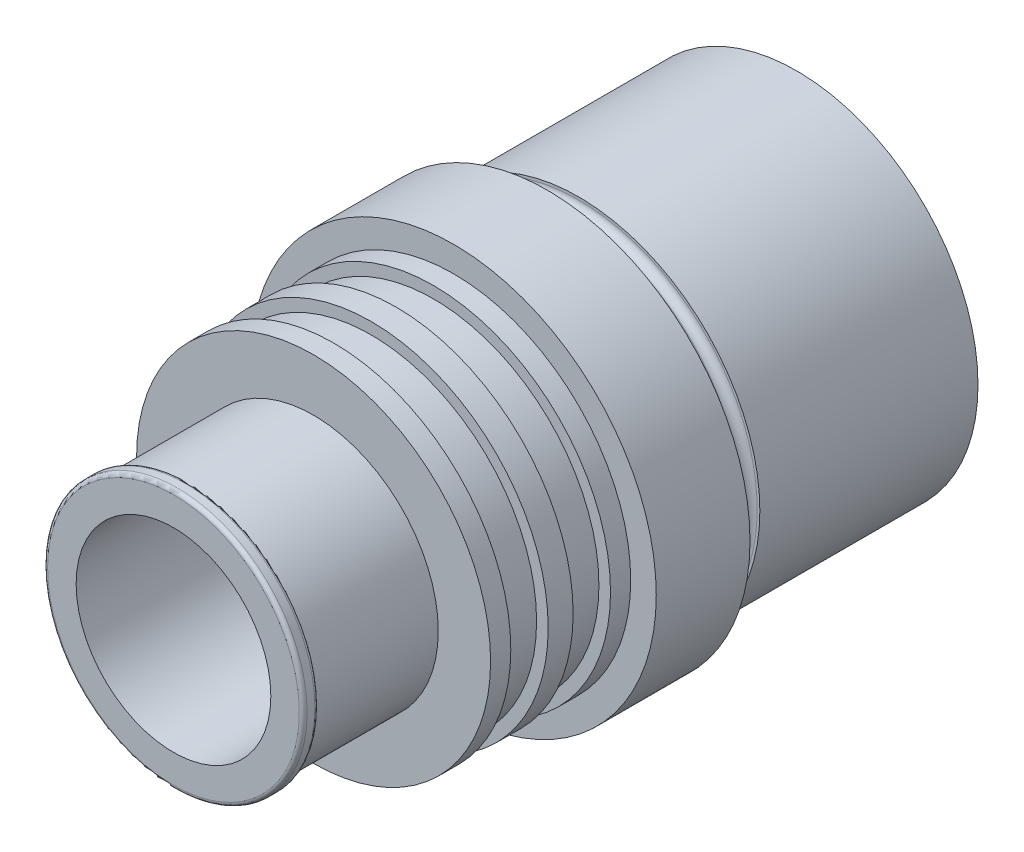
ISO-10303-21;
HEADER;
FILE_DESCRIPTION(('STEP AP214'),'2;1');
FILE_NAME('part.step','',(''),(''),'','','');
FILE_SCHEMA(('AUTOMOTIVE_DESIGN { 1 0 10303 214 1 1 1 1 }'));
ENDSEC;
DATA;
#1=APPLICATION_CONTEXT('core data for automotive mechanical design processes');
#2=APPLICATION_PROTOCOL_DEFINITION('international standard','automotive_design',2000,#1);
#3=PRODUCT_CONTEXT('',#1,'mechanical');
#4=PRODUCT('Part','Part','',(#3));
#5=PRODUCT_RELATED_PRODUCT_CATEGORY('part','',(#4));
#6=PRODUCT_DEFINITION_FORMATION('','',#4);
#7=PRODUCT_DEFINITION_CONTEXT('part definition',#1,'design');
#8=PRODUCT_DEFINITION('design','',#6,#7);
#9=PRODUCT_DEFINITION_SHAPE('','',#8);
#10=(LENGTH_UNIT() NAMED_UNIT(*) SI_UNIT(.MILLI.,.METRE.));
#11=(NAMED_UNIT(*) PLANE_ANGLE_UNIT() SI_UNIT($,.RADIAN.));
#12=(NAMED_UNIT(*) SI_UNIT($,.STERADIAN.) SOLID_ANGLE_UNIT());
#13=UNCERTAINTY_MEASURE_WITH_UNIT(LENGTH_MEASURE(1.E-05),#10,'distance_accuracy_value','');
#14=(GEOMETRIC_REPRESENTATION_CONTEXT(3) GLOBAL_UNCERTAINTY_ASSIGNED_CONTEXT((#13)) GLOBAL_UNIT_ASSIGNED_CONTEXT((#10,
#11,#12)) REPRESENTATION_CONTEXT('',''));
#15=CARTESIAN_POINT('',(0.,0.,0.));
#16=DIRECTION('',(0.,0.,1.));
#17=DIRECTION('',(1.,0.,0.));
#18=AXIS2_PLACEMENT_3D('',#15,#16,#17);
#19=CARTESIAN_POINT('',(0.,0.,31.75));
#20=DIRECTION('',(0.,0.,-1.));
#21=DIRECTION('',(-1.,0.,0.));
#22=AXIS2_PLACEMENT_3D('',#19,#20,#21);
#23=PLANE('',#22);
#24=CARTESIAN_POINT('',(0.,0.,31.75));
#25=DIRECTION('',(0.,0.,-1.));
#26=DIRECTION('',(-1.,0.,0.));
#27=AXIS2_PLACEMENT_3D('',#24,#25,#26);
#28=CIRCLE('',#27,12.823825);
#29=CARTESIAN_POINT('',(-12.823825,0.,31.75));
#30=VERTEX_POINT('',#29);
#31=EDGE_CURVE('E10',#30,#30,#28,.F.);
#32=ORIENTED_EDGE('',*,*,#31,.T.);
#33=EDGE_LOOP('',(#32));
#34=FACE_BOUND('',#33,.T.);
#35=CARTESIAN_POINT('',(0.,0.,31.75));
#36=DIRECTION('',(0.,0.,1.));
#37=DIRECTION('',(1.,0.,0.));
#38=AXIS2_PLACEMENT_3D('',#35,#36,#37);
#39=CIRCLE('',#38,9.9187);
#40=CARTESIAN_POINT('',(9.9187,0.,31.75));
#41=VERTEX_POINT('',#40);
#42=EDGE_CURVE('E114',#41,#41,#39,.T.);
#43=ORIENTED_EDGE('',*,*,#42,.F.);
#44=EDGE_LOOP('',(#43));
#45=FACE_BOUND('',#44,.T.);
#46=ADVANCED_FACE('F29',(#34,#45),#23,.F.);
#47=CARTESIAN_POINT('',(0.,18.4658,-31.75));
#48=DIRECTION('',(0.,0.,1.));
#49=DIRECTION('',(1.,0.,0.));
#50=AXIS2_PLACEMENT_3D('',#47,#48,#49);
#51=PLANE('',#50);
#52=CARTESIAN_POINT('',(0.,0.,-31.75));
#53=DIRECTION('',(0.,0.,1.));
#54=DIRECTION('',(1.,0.,0.));
#55=AXIS2_PLACEMENT_3D('',#52,#53,#54);
#56=CIRCLE('',#55,16.66875);
#57=CARTESIAN_POINT('',(-16.66875,0.,-31.75));
#58=VERTEX_POINT('',#57);
#59=EDGE_CURVE('E51',#58,#58,#56,.T.);
#60=ORIENTED_EDGE('',*,*,#59,.T.);
#61=EDGE_LOOP('',(#60));
#62=FACE_BOUND('',#61,.T.);
#63=CARTESIAN_POINT('',(0.,0.,-31.75));
#64=DIRECTION('',(0.,0.,1.));
#65=DIRECTION('',(1.,0.,0.));
#66=AXIS2_PLACEMENT_3D('',#63,#64,#65);
#67=CIRCLE('',#66,18.4658);
#68=CARTESIAN_POINT('',(18.4658,0.,-31.75));
#69=VERTEX_POINT('',#68);
#70=EDGE_CURVE('E111',#69,#69,#67,.T.);
#71=ORIENTED_EDGE('',*,*,#70,.F.);
#72=EDGE_LOOP('',(#71));
#73=FACE_BOUND('',#72,.T.);
#74=ADVANCED_FACE('F148',(#62,#73),#51,.F.);
#75=CARTESIAN_POINT('',(0.,0.,38.7245671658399));
#76=DIRECTION('',(0.,0.,1.));
#77=DIRECTION('',(1.,0.,0.));
#78=AXIS2_PLACEMENT_3D('',#75,#76,#77);
#79=CYLINDRICAL_SURFACE('',#78,13.2207);
#80=CARTESIAN_POINT('',(0.,0.,30.559375));
#81=DIRECTION('',(0.,0.,1.));
#82=DIRECTION('',(1.,0.,0.));
#83=AXIS2_PLACEMENT_3D('',#80,#81,#82);
#84=CIRCLE('',#83,13.2207);
#85=CARTESIAN_POINT('',(13.2207,0.,30.559375));
#86=VERTEX_POINT('',#85);
#87=EDGE_CURVE('E39',#86,#86,#84,.T.);
#88=ORIENTED_EDGE('',*,*,#87,.T.);
#89=EDGE_LOOP('',(#88));
#90=FACE_BOUND('',#89,.T.);
#91=CARTESIAN_POINT('',(0.,0.,31.353125));
#92=DIRECTION('',(0.,0.,-1.));
#93=DIRECTION('',(-1.,0.,0.));
#94=AXIS2_PLACEMENT_3D('',#91,#92,#93);
#95=CIRCLE('',#94,13.2207);
#96=CARTESIAN_POINT('',(-13.2207,0.,31.353125));
#97=VERTEX_POINT('',#96);
#98=EDGE_CURVE('E43',#97,#97,#95,.T.);
#99=ORIENTED_EDGE('',*,*,#98,.T.);
#100=EDGE_LOOP('',(#99));
#101=FACE_BOUND('',#100,.T.);
#102=ADVANCED_FACE('F152',(#90,#101),#79,.T.);
#103=CARTESIAN_POINT('',(0.,13.2207,30.1625));
#104=DIRECTION('',(0.,0.,1.));
#105=DIRECTION('',(1.,0.,0.));
#106=AXIS2_PLACEMENT_3D('',#103,#104,#105);
#107=PLANE('',#106);
#108=CARTESIAN_POINT('',(0.,0.,30.1625));
#109=DIRECTION('',(0.,0.,1.));
#110=DIRECTION('',(1.,0.,0.));
#111=AXIS2_PLACEMENT_3D('',#108,#109,#110);
#112=CIRCLE('',#111,12.823825);
#113=CARTESIAN_POINT('',(12.823825,0.,30.1625));
#114=VERTEX_POINT('',#113);
#115=EDGE_CURVE('E35',#114,#114,#112,.F.);
#116=ORIENTED_EDGE('',*,*,#115,.T.);
#117=EDGE_LOOP('',(#116));
#118=FACE_BOUND('',#117,.T.);
#119=CARTESIAN_POINT('',(0.,0.,30.1625));
#120=DIRECTION('',(0.,0.,1.));
#121=DIRECTION('',(1.,0.,0.));
#122=AXIS2_PLACEMENT_3D('',#119,#120,#121);
#123=CIRCLE('',#122,12.7);
#124=CARTESIAN_POINT('',(12.7,0.,30.1625));
#125=VERTEX_POINT('',#124);
#126=EDGE_CURVE('E66',#125,#125,#123,.T.);
#127=ORIENTED_EDGE('',*,*,#126,.T.);
#128=EDGE_LOOP('',(#127));
#129=FACE_BOUND('',#128,.T.);
#130=ADVANCED_FACE('F240',(#118,#129),#107,.F.);
#131=CARTESIAN_POINT('',(0.,0.,38.7245671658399));
#132=DIRECTION('',(0.,0.,1.));
#133=DIRECTION('',(1.,0.,0.));
#134=AXIS2_PLACEMENT_3D('',#131,#132,#133);
#135=CYLINDRICAL_SURFACE('',#134,12.7);
#136=ORIENTED_EDGE('',*,*,#126,.F.);
#137=EDGE_LOOP('',(#136));
#138=FACE_BOUND('',#137,.T.);
#139=CARTESIAN_POINT('',(0.,0.,17.4752));
#140=DIRECTION('',(0.,0.,1.));
#141=DIRECTION('',(1.,0.,0.));
#142=AXIS2_PLACEMENT_3D('',#139,#140,#141);
#143=CIRCLE('',#142,12.7);
#144=CARTESIAN_POINT('',(12.7,0.,17.4752));
#145=VERTEX_POINT('',#144);
#146=EDGE_CURVE('E69',#145,#145,#143,.T.);
#147=ORIENTED_EDGE('',*,*,#146,.T.);
#148=EDGE_LOOP('',(#147));
#149=FACE_BOUND('',#148,.T.);
#150=ADVANCED_FACE('F236',(#138,#149),#135,.T.);
#151=CARTESIAN_POINT('',(0.,12.7,17.4752));
#152=DIRECTION('',(0.,0.,-1.));
#153=DIRECTION('',(-1.,0.,0.));
#154=AXIS2_PLACEMENT_3D('',#151,#152,#153);
#155=PLANE('',#154);
#156=ORIENTED_EDGE('',*,*,#146,.F.);
#157=EDGE_LOOP('',(#156));
#158=FACE_BOUND('',#157,.T.);
#159=CARTESIAN_POINT('',(0.,0.,17.4752));
#160=DIRECTION('',(0.,0.,1.));
#161=DIRECTION('',(1.,0.,0.));
#162=AXIS2_PLACEMENT_3D('',#159,#160,#161);
#163=CIRCLE('',#162,18.034);
#164=CARTESIAN_POINT('',(18.034,0.,17.4752));
#165=VERTEX_POINT('',#164);
#166=EDGE_CURVE('E72',#165,#165,#163,.T.);
#167=ORIENTED_EDGE('',*,*,#166,.T.);
#168=EDGE_LOOP('',(#167));
#169=FACE_BOUND('',#168,.T.);
#170=ADVANCED_FACE('F232',(#158,#169),#155,.F.);
#171=CARTESIAN_POINT('',(0.,0.,38.7245671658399));
#172=DIRECTION('',(0.,0.,1.));
#173=DIRECTION('',(1.,0.,0.));
#174=AXIS2_PLACEMENT_3D('',#171,#172,#173);
#175=CYLINDRICAL_SURFACE('',#174,18.034);
#176=ORIENTED_EDGE('',*,*,#166,.F.);
#177=EDGE_LOOP('',(#176));
#178=FACE_BOUND('',#177,.T.);
#179=CARTESIAN_POINT('',(0.,0.,15.4178));
#180=DIRECTION('',(0.,0.,1.));
#181=DIRECTION('',(1.,0.,0.));
#182=AXIS2_PLACEMENT_3D('',#179,#180,#181);
#183=CIRCLE('',#182,18.034);
#184=CARTESIAN_POINT('',(18.034,0.,15.4178));
#185=VERTEX_POINT('',#184);
#186=EDGE_CURVE('E75',#185,#185,#183,.T.);
#187=ORIENTED_EDGE('',*,*,#186,.T.);
#188=EDGE_LOOP('',(#187));
#189=FACE_BOUND('',#188,.T.);
#190=ADVANCED_FACE('F228',(#178,#189),#175,.T.);
#191=CARTESIAN_POINT('',(0.,18.034,15.4178));
#192=DIRECTION('',(0.,0.,1.));
#193=DIRECTION('',(1.,0.,0.));
#194=AXIS2_PLACEMENT_3D('',#191,#192,#193);
#195=PLANE('',#194);
#196=ORIENTED_EDGE('',*,*,#186,.F.);
#197=EDGE_LOOP('',(#196));
#198=FACE_BOUND('',#197,.T.);
#199=CARTESIAN_POINT('',(0.,0.,15.4178));
#200=DIRECTION('',(0.,0.,1.));
#201=DIRECTION('',(1.,0.,0.));
#202=AXIS2_PLACEMENT_3D('',#199,#200,#201);
#203=CIRCLE('',#202,16.8529);
#204=CARTESIAN_POINT('',(16.8529,0.,15.4178));
#205=VERTEX_POINT('',#204);
#206=EDGE_CURVE('E78',#205,#205,#203,.T.);
#207=ORIENTED_EDGE('',*,*,#206,.T.);
#208=EDGE_LOOP('',(#207));
#209=FACE_BOUND('',#208,.T.);
#210=ADVANCED_FACE('F224',(#198,#209),#195,.F.);
#211=CARTESIAN_POINT('',(0.,0.,38.7245671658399));
#212=DIRECTION('',(0.,0.,1.));
#213=DIRECTION('',(1.,0.,0.));
#214=AXIS2_PLACEMENT_3D('',#211,#212,#213);
#215=CYLINDRICAL_SURFACE('',#214,16.8529);
#216=ORIENTED_EDGE('',*,*,#206,.F.);
#217=EDGE_LOOP('',(#216));
#218=FACE_BOUND('',#217,.T.);
#219=CARTESIAN_POINT('',(0.,0.,11.6078));
#220=DIRECTION('',(0.,0.,1.));
#221=DIRECTION('',(1.,0.,0.));
#222=AXIS2_PLACEMENT_3D('',#219,#220,#221);
#223=CIRCLE('',#222,16.8529);
#224=CARTESIAN_POINT('',(16.8529,0.,11.6078));
#225=VERTEX_POINT('',#224);
#226=EDGE_CURVE('E81',#225,#225,#223,.T.);
#227=ORIENTED_EDGE('',*,*,#226,.T.);
#228=EDGE_LOOP('',(#227));
#229=FACE_BOUND('',#228,.T.);
#230=ADVANCED_FACE('F220',(#218,#229),#215,.T.);
#231=CARTESIAN_POINT('',(0.,16.8529,11.6078));
#232=DIRECTION('',(0.,0.,-1.));
#233=DIRECTION('',(-1.,0.,0.));
#234=AXIS2_PLACEMENT_3D('',#231,#232,#233);
#235=PLANE('',#234);
#236=ORIENTED_EDGE('',*,*,#226,.F.);
#237=EDGE_LOOP('',(#236));
#238=FACE_BOUND('',#237,.T.);
#239=CARTESIAN_POINT('',(0.,0.,11.6078));
#240=DIRECTION('',(0.,0.,1.));
#241=DIRECTION('',(1.,0.,0.));
#242=AXIS2_PLACEMENT_3D('',#239,#240,#241);
#243=CIRCLE('',#242,18.034);
#244=CARTESIAN_POINT('',(18.034,0.,11.6078));
#245=VERTEX_POINT('',#244);
#246=EDGE_CURVE('E84',#245,#245,#243,.T.);
#247=ORIENTED_EDGE('',*,*,#246,.T.);
#248=EDGE_LOOP('',(#247));
#249=FACE_BOUND('',#248,.T.);
#250=ADVANCED_FACE('F216',(#238,#249),#235,.F.);
#251=CARTESIAN_POINT('',(0.,0.,38.7245671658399));
#252=DIRECTION('',(0.,0.,1.));
#253=DIRECTION('',(1.,0.,0.));
#254=AXIS2_PLACEMENT_3D('',#251,#252,#253);
#255=CYLINDRICAL_SURFACE('',#254,18.034);
#256=ORIENTED_EDGE('',*,*,#246,.F.);
#257=EDGE_LOOP('',(#256));
#258=FACE_BOUND('',#257,.T.);
#259=CARTESIAN_POINT('',(0.,0.,9.0678));
#260=DIRECTION('',(0.,0.,1.));
#261=DIRECTION('',(1.,0.,0.));
#262=AXIS2_PLACEMENT_3D('',#259,#260,#261);
#263=CIRCLE('',#262,18.034);
#264=CARTESIAN_POINT('',(18.034,0.,9.0678));
#265=VERTEX_POINT('',#264);
#266=EDGE_CURVE('E87',#265,#265,#263,.T.);
#267=ORIENTED_EDGE('',*,*,#266,.T.);
#268=EDGE_LOOP('',(#267));
#269=FACE_BOUND('',#268,.T.);
#270=ADVANCED_FACE('F212',(#258,#269),#255,.T.);
#271=CARTESIAN_POINT('',(0.,18.034,9.0678));
#272=DIRECTION('',(0.,0.,1.));
#273=DIRECTION('',(1.,0.,0.));
#274=AXIS2_PLACEMENT_3D('',#271,#272,#273);
#275=PLANE('',#274);
#276=ORIENTED_EDGE('',*,*,#266,.F.);
#277=EDGE_LOOP('',(#276));
#278=FACE_BOUND('',#277,.T.);
#279=CARTESIAN_POINT('',(0.,0.,9.0678));
#280=DIRECTION('',(0.,0.,1.));
#281=DIRECTION('',(1.,0.,0.));
#282=AXIS2_PLACEMENT_3D('',#279,#280,#281);
#283=CIRCLE('',#282,16.8529);
#284=CARTESIAN_POINT('',(16.8529,0.,9.0678));
#285=VERTEX_POINT('',#284);
#286=EDGE_CURVE('E90',#285,#285,#283,.T.);
#287=ORIENTED_EDGE('',*,*,#286,.T.);
#288=EDGE_LOOP('',(#287));
#289=FACE_BOUND('',#288,.T.);
#290=ADVANCED_FACE('F208',(#278,#289),#275,.F.);
#291=CARTESIAN_POINT('',(0.,0.,38.7245671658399));
#292=DIRECTION('',(0.,0.,1.));
#293=DIRECTION('',(1.,0.,0.));
#294=AXIS2_PLACEMENT_3D('',#291,#292,#293);
#295=CYLINDRICAL_SURFACE('',#294,16.8529);
#296=ORIENTED_EDGE('',*,*,#286,.F.);
#297=EDGE_LOOP('',(#296));
#298=FACE_BOUND('',#297,.T.);
#299=CARTESIAN_POINT('',(0.,0.,5.2578));
#300=DIRECTION('',(0.,0.,1.));
#301=DIRECTION('',(1.,0.,0.));
#302=AXIS2_PLACEMENT_3D('',#299,#300,#301);
#303=CIRCLE('',#302,16.8529);
#304=CARTESIAN_POINT('',(16.8529,0.,5.2578));
#305=VERTEX_POINT('',#304);
#306=EDGE_CURVE('E93',#305,#305,#303,.T.);
#307=ORIENTED_EDGE('',*,*,#306,.T.);
#308=EDGE_LOOP('',(#307));
#309=FACE_BOUND('',#308,.T.);
#310=ADVANCED_FACE('F204',(#298,#309),#295,.T.);
#311=CARTESIAN_POINT('',(0.,16.8529,5.2578));
#312=DIRECTION('',(0.,0.,-1.));
#313=DIRECTION('',(-1.,0.,0.));
#314=AXIS2_PLACEMENT_3D('',#311,#312,#313);
#315=PLANE('',#314);
#316=ORIENTED_EDGE('',*,*,#306,.F.);
#317=EDGE_LOOP('',(#316));
#318=FACE_BOUND('',#317,.T.);
#319=CARTESIAN_POINT('',(0.,0.,5.2578));
#320=DIRECTION('',(0.,0.,1.));
#321=DIRECTION('',(1.,0.,0.));
#322=AXIS2_PLACEMENT_3D('',#319,#320,#321);
#323=CIRCLE('',#322,18.034);
#324=CARTESIAN_POINT('',(18.034,0.,5.2578));
#325=VERTEX_POINT('',#324);
#326=EDGE_CURVE('E96',#325,#325,#323,.T.);
#327=ORIENTED_EDGE('',*,*,#326,.T.);
#328=EDGE_LOOP('',(#327));
#329=FACE_BOUND('',#328,.T.);
#330=ADVANCED_FACE('F200',(#318,#329),#315,.F.);
#331=CARTESIAN_POINT('',(0.,0.,38.7245671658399));
#332=DIRECTION('',(0.,0.,1.));
#333=DIRECTION('',(1.,0.,0.));
#334=AXIS2_PLACEMENT_3D('',#331,#332,#333);
#335=CYLINDRICAL_SURFACE('',#334,18.034);
#336=ORIENTED_EDGE('',*,*,#326,.F.);
#337=EDGE_LOOP('',(#336));
#338=FACE_BOUND('',#337,.T.);
#339=CARTESIAN_POINT('',(0.,0.,3.2004));
#340=DIRECTION('',(0.,0.,1.));
#341=DIRECTION('',(1.,0.,0.));
#342=AXIS2_PLACEMENT_3D('',#339,#340,#341);
#343=CIRCLE('',#342,18.034);
#344=CARTESIAN_POINT('',(18.034,0.,3.2004));
#345=VERTEX_POINT('',#344);
#346=EDGE_CURVE('E99',#345,#345,#343,.T.);
#347=ORIENTED_EDGE('',*,*,#346,.T.);
#348=EDGE_LOOP('',(#347));
#349=FACE_BOUND('',#348,.T.);
#350=ADVANCED_FACE('F196',(#338,#349),#335,.T.);
#351=CARTESIAN_POINT('',(0.,18.034,3.2004));
#352=DIRECTION('',(0.,0.,-1.));
#353=DIRECTION('',(-1.,0.,0.));
#354=AXIS2_PLACEMENT_3D('',#351,#352,#353);
#355=PLANE('',#354);
#356=ORIENTED_EDGE('',*,*,#346,.F.);
#357=EDGE_LOOP('',(#356));
#358=FACE_BOUND('',#357,.T.);
#359=CARTESIAN_POINT('',(0.,0.,3.2004));
#360=DIRECTION('',(0.,0.,1.));
#361=DIRECTION('',(1.,0.,0.));
#362=AXIS2_PLACEMENT_3D('',#359,#360,#361);
#363=CIRCLE('',#362,20.6375);
#364=CARTESIAN_POINT('',(20.6375,0.,3.2004));
#365=VERTEX_POINT('',#364);
#366=EDGE_CURVE('E102',#365,#365,#363,.T.);
#367=ORIENTED_EDGE('',*,*,#366,.T.);
#368=EDGE_LOOP('',(#367));
#369=FACE_BOUND('',#368,.T.);
#370=ADVANCED_FACE('F192',(#358,#369),#355,.F.);
#371=CARTESIAN_POINT('',(0.,0.,38.7245671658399));
#372=DIRECTION('',(0.,0.,1.));
#373=DIRECTION('',(1.,0.,0.));
#374=AXIS2_PLACEMENT_3D('',#371,#372,#373);
#375=CYLINDRICAL_SURFACE('',#374,20.6375);
#376=ORIENTED_EDGE('',*,*,#366,.F.);
#377=EDGE_LOOP('',(#376));
#378=FACE_BOUND('',#377,.T.);
#379=CARTESIAN_POINT('',(0.,0.,-6.35));
#380=DIRECTION('',(0.,0.,1.));
#381=DIRECTION('',(1.,0.,0.));
#382=AXIS2_PLACEMENT_3D('',#379,#380,#381);
#383=CIRCLE('',#382,20.6375);
#384=CARTESIAN_POINT('',(20.6375,0.,-6.35));
#385=VERTEX_POINT('',#384);
#386=EDGE_CURVE('E105',#385,#385,#383,.T.);
#387=ORIENTED_EDGE('',*,*,#386,.T.);
#388=EDGE_LOOP('',(#387));
#389=FACE_BOUND('',#388,.T.);
#390=ADVANCED_FACE('F188',(#378,#389),#375,.T.);
#391=CARTESIAN_POINT('',(0.,20.6375,-6.35));
#392=DIRECTION('',(0.,0.,1.));
#393=DIRECTION('',(1.,0.,0.));
#394=AXIS2_PLACEMENT_3D('',#391,#392,#393);
#395=PLANE('',#394);
#396=CARTESIAN_POINT('',(0.,0.,-6.35));
#397=DIRECTION('',(0.,0.,1.));
#398=DIRECTION('',(1.,0.,0.));
#399=AXIS2_PLACEMENT_3D('',#396,#397,#398);
#400=CIRCLE('',#399,18.19275);
#401=CARTESIAN_POINT('',(18.19275,0.,-6.35));
#402=VERTEX_POINT('',#401);
#403=EDGE_CURVE('E54',#402,#402,#400,.T.);
#404=ORIENTED_EDGE('',*,*,#403,.T.);
#405=EDGE_LOOP('',(#404));
#406=FACE_BOUND('',#405,.T.);
#407=ORIENTED_EDGE('',*,*,#386,.F.);
#408=EDGE_LOOP('',(#407));
#409=FACE_BOUND('',#408,.T.);
#410=ADVANCED_FACE('F184',(#406,#409),#395,.F.);
#411=CARTESIAN_POINT('',(0.,0.,38.7245671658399));
#412=DIRECTION('',(0.,0.,1.));
#413=DIRECTION('',(1.,0.,0.));
#414=AXIS2_PLACEMENT_3D('',#411,#412,#413);
#415=CYLINDRICAL_SURFACE('',#414,17.399);
#416=CARTESIAN_POINT('',(0.,0.,-8.73125));
#417=DIRECTION('',(0.,0.,-1.));
#418=DIRECTION('',(-1.,0.,0.));
#419=AXIS2_PLACEMENT_3D('',#416,#417,#418);
#420=CIRCLE('',#419,17.399);
#421=CARTESIAN_POINT('',(-17.399,0.,-8.73125));
#422=VERTEX_POINT('',#421);
#423=EDGE_CURVE('E60',#422,#422,#420,.F.);
#424=ORIENTED_EDGE('',*,*,#423,.T.);
#425=EDGE_LOOP('',(#424));
#426=FACE_BOUND('',#425,.T.);
#427=CARTESIAN_POINT('',(0.,0.,-7.14375));
#428=DIRECTION('',(0.,0.,1.));
#429=DIRECTION('',(1.,0.,0.));
#430=AXIS2_PLACEMENT_3D('',#427,#428,#429);
#431=CIRCLE('',#430,17.399);
#432=CARTESIAN_POINT('',(17.399,0.,-7.14375));
#433=VERTEX_POINT('',#432);
#434=EDGE_CURVE('E63',#433,#433,#431,.F.);
#435=ORIENTED_EDGE('',*,*,#434,.T.);
#436=EDGE_LOOP('',(#435));
#437=FACE_BOUND('',#436,.T.);
#438=ADVANCED_FACE('F180',(#426,#437),#415,.T.);
#439=CARTESIAN_POINT('',(0.,17.399,-9.525));
#440=DIRECTION('',(0.,0.,-1.));
#441=DIRECTION('',(-1.,0.,0.));
#442=AXIS2_PLACEMENT_3D('',#439,#440,#441);
#443=PLANE('',#442);
#444=CARTESIAN_POINT('',(0.,0.,-9.525));
#445=DIRECTION('',(0.,0.,-1.));
#446=DIRECTION('',(-1.,0.,0.));
#447=AXIS2_PLACEMENT_3D('',#444,#445,#446);
#448=CIRCLE('',#447,18.19275);
#449=CARTESIAN_POINT('',(-18.19275,0.,-9.525));
#450=VERTEX_POINT('',#449);
#451=EDGE_CURVE('E57',#450,#450,#448,.T.);
#452=ORIENTED_EDGE('',*,*,#451,.T.);
#453=EDGE_LOOP('',(#452));
#454=FACE_BOUND('',#453,.T.);
#455=CARTESIAN_POINT('',(0.,0.,-9.52500000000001));
#456=DIRECTION('',(0.,0.,1.));
#457=DIRECTION('',(1.,0.,0.));
#458=AXIS2_PLACEMENT_3D('',#455,#456,#457);
#459=CIRCLE('',#458,18.4658);
#460=CARTESIAN_POINT('',(18.4658,0.,-9.52500000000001));
#461=VERTEX_POINT('',#460);
#462=EDGE_CURVE('E108',#461,#461,#459,.T.);
#463=ORIENTED_EDGE('',*,*,#462,.T.);
#464=EDGE_LOOP('',(#463));
#465=FACE_BOUND('',#464,.T.);
#466=ADVANCED_FACE('F176',(#454,#465),#443,.F.);
#467=CARTESIAN_POINT('',(0.,0.,38.7245671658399));
#468=DIRECTION('',(0.,0.,1.));
#469=DIRECTION('',(1.,0.,0.));
#470=AXIS2_PLACEMENT_3D('',#467,#468,#469);
#471=CYLINDRICAL_SURFACE('',#470,18.4658);
#472=ORIENTED_EDGE('',*,*,#462,.F.);
#473=EDGE_LOOP('',(#472));
#474=FACE_BOUND('',#473,.T.);
#475=ORIENTED_EDGE('',*,*,#70,.T.);
#476=EDGE_LOOP('',(#475));
#477=FACE_BOUND('',#476,.T.);
#478=ADVANCED_FACE('F161',(#474,#477),#471,.T.);
#479=CARTESIAN_POINT('',(0.,0.,35.1669093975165));
#480=DIRECTION('',(0.,0.,1.));
#481=DIRECTION('',(1.,0.,0.));
#482=AXIS2_PLACEMENT_3D('',#479,#480,#481);
#483=CYLINDRICAL_SURFACE('',#482,9.9187);
#484=ORIENTED_EDGE('',*,*,#42,.T.);
#485=EDGE_LOOP('',(#484));
#486=FACE_BOUND('',#485,.T.);
#487=CARTESIAN_POINT('',(0.,0.,15.08125));
#488=DIRECTION('',(0.,0.,1.));
#489=DIRECTION('',(1.,0.,0.));
#490=AXIS2_PLACEMENT_3D('',#487,#488,#489);
#491=CIRCLE('',#490,9.9187);
#492=CARTESIAN_POINT('',(9.9187,0.,15.08125));
#493=VERTEX_POINT('',#492);
#494=EDGE_CURVE('E117',#493,#493,#491,.T.);
#495=ORIENTED_EDGE('',*,*,#494,.F.);
#496=EDGE_LOOP('',(#495));
#497=FACE_BOUND('',#496,.T.);
#498=ADVANCED_FACE('F158',(#486,#497),#483,.F.);
#499=CARTESIAN_POINT('',(0.,9.9187,15.08125));
#500=DIRECTION('',(0.,0.,-1.));
#501=DIRECTION('',(-1.,0.,0.));
#502=AXIS2_PLACEMENT_3D('',#499,#500,#501);
#503=PLANE('',#502);
#504=ORIENTED_EDGE('',*,*,#494,.T.);
#505=EDGE_LOOP('',(#504));
#506=FACE_BOUND('',#505,.T.);
#507=CARTESIAN_POINT('',(0.,0.,15.08125));
#508=DIRECTION('',(0.,0.,1.));
#509=DIRECTION('',(1.,0.,0.));
#510=AXIS2_PLACEMENT_3D('',#507,#508,#509);
#511=CIRCLE('',#510,11.90625);
#512=CARTESIAN_POINT('',(11.90625,0.,15.08125));
#513=VERTEX_POINT('',#512);
#514=EDGE_CURVE('E120',#513,#513,#511,.T.);
#515=ORIENTED_EDGE('',*,*,#514,.F.);
#516=EDGE_LOOP('',(#515));
#517=FACE_BOUND('',#516,.T.);
#518=ADVANCED_FACE('F144',(#506,#517),#503,.T.);
#519=CARTESIAN_POINT('',(0.,0.,35.1669093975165));
#520=DIRECTION('',(0.,0.,1.));
#521=DIRECTION('',(1.,0.,0.));
#522=AXIS2_PLACEMENT_3D('',#519,#520,#521);
#523=CYLINDRICAL_SURFACE('',#522,11.90625);
#524=ORIENTED_EDGE('',*,*,#514,.T.);
#525=EDGE_LOOP('',(#524));
#526=FACE_BOUND('',#525,.T.);
#527=CARTESIAN_POINT('',(0.,0.,9.525));
#528=DIRECTION('',(0.,0.,1.));
#529=DIRECTION('',(1.,0.,0.));
#530=AXIS2_PLACEMENT_3D('',#527,#528,#529);
#531=CIRCLE('',#530,11.90625);
#532=CARTESIAN_POINT('',(11.90625,0.,9.525));
#533=VERTEX_POINT('',#532);
#534=EDGE_CURVE('E123',#533,#533,#531,.T.);
#535=ORIENTED_EDGE('',*,*,#534,.F.);
#536=EDGE_LOOP('',(#535));
#537=FACE_BOUND('',#536,.T.);
#538=ADVANCED_FACE('F134',(#526,#537),#523,.F.);
#539=CARTESIAN_POINT('',(0.,0.,6.35000000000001));
#540=DIRECTION('',(0.,0.,-1.));
#541=DIRECTION('',(-1.,0.,0.));
#542=AXIS2_PLACEMENT_3D('',#539,#540,#541);
#543=CONICAL_SURFACE('',#542,15.08125,0.78539816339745);
#544=ORIENTED_EDGE('',*,*,#534,.T.);
#545=EDGE_LOOP('',(#544));
#546=FACE_BOUND('',#545,.T.);
#547=CARTESIAN_POINT('',(0.,0.,6.35000000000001));
#548=DIRECTION('',(0.,0.,1.));
#549=DIRECTION('',(1.,0.,0.));
#550=AXIS2_PLACEMENT_3D('',#547,#548,#549);
#551=CIRCLE('',#550,15.08125);
#552=CARTESIAN_POINT('',(15.08125,0.,6.35000000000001));
#553=VERTEX_POINT('',#552);
#554=EDGE_CURVE('E126',#553,#553,#551,.T.);
#555=ORIENTED_EDGE('',*,*,#554,.F.);
#556=EDGE_LOOP('',(#555));
#557=FACE_BOUND('',#556,.T.);
#558=ADVANCED_FACE('F132',(#546,#557),#543,.F.);
#559=CARTESIAN_POINT('',(0.,0.,35.1669093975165));
#560=DIRECTION('',(0.,0.,1.));
#561=DIRECTION('',(1.,0.,0.));
#562=AXIS2_PLACEMENT_3D('',#559,#560,#561);
#563=CYLINDRICAL_SURFACE('',#562,15.08125);
#564=CARTESIAN_POINT('',(0.,0.,-30.1625));
#565=DIRECTION('',(0.,0.,1.));
#566=DIRECTION('',(1.,0.,0.));
#567=AXIS2_PLACEMENT_3D('',#564,#565,#566);
#568=CIRCLE('',#567,15.08125);
#569=CARTESIAN_POINT('',(-15.08125,0.,-30.1625));
#570=VERTEX_POINT('',#569);
#571=EDGE_CURVE('E48',#570,#570,#568,.F.);
#572=ORIENTED_EDGE('',*,*,#571,.T.);
#573=EDGE_LOOP('',(#572));
#574=FACE_BOUND('',#573,.T.);
#575=ORIENTED_EDGE('',*,*,#554,.T.);
#576=EDGE_LOOP('',(#575));
#577=FACE_BOUND('',#576,.T.);
#578=ADVANCED_FACE('F130',(#574,#577),#563,.F.);
#579=CARTESIAN_POINT('',(0.,0.,-8.73125));
#580=DIRECTION('',(0.,0.,-1.));
#581=DIRECTION('',(-1.,0.,0.));
#582=AXIS2_PLACEMENT_3D('',#579,#580,#581);
#583=TOROIDAL_SURFACE('',#582,18.19275,0.79375);
#584=ORIENTED_EDGE('',*,*,#451,.F.);
#585=EDGE_LOOP('',(#584));
#586=FACE_BOUND('',#585,.T.);
#587=ORIENTED_EDGE('',*,*,#423,.F.);
#588=EDGE_LOOP('',(#587));
#589=FACE_BOUND('',#588,.T.);
#590=ADVANCED_FACE('F141',(#586,#589),#583,.F.);
#591=CARTESIAN_POINT('',(0.,0.,-7.14375));
#592=DIRECTION('',(0.,0.,1.));
#593=DIRECTION('',(1.,0.,0.));
#594=AXIS2_PLACEMENT_3D('',#591,#592,#593);
#595=TOROIDAL_SURFACE('',#594,18.19275,0.79375);
#596=ORIENTED_EDGE('',*,*,#434,.F.);
#597=EDGE_LOOP('',(#596));
#598=FACE_BOUND('',#597,.T.);
#599=ORIENTED_EDGE('',*,*,#403,.F.);
#600=EDGE_LOOP('',(#599));
#601=FACE_BOUND('',#600,.T.);
#602=ADVANCED_FACE('F265',(#598,#601),#595,.F.);
#603=CARTESIAN_POINT('',(0.,0.,-31.75));
#604=DIRECTION('',(0.,0.,-1.));
#605=DIRECTION('',(-1.,0.,0.));
#606=AXIS2_PLACEMENT_3D('',#603,#604,#605);
#607=CONICAL_SURFACE('',#606,16.66875,0.785398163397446);
#608=CARTESIAN_POINT('',(-15.08125,0.,-30.1625));
#609=CARTESIAN_POINT('',(-15.0977864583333,0.,-30.1790364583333));
#610=CARTESIAN_POINT('',(-15.1143229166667,0.,-30.1955729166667));
#611=CARTESIAN_POINT('',(-15.1473958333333,0.,-30.2286458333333));
#612=CARTESIAN_POINT('',(-15.1639322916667,0.,-30.2451822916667));
#613=CARTESIAN_POINT('',(-15.1970052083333,0.,-30.2782552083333));
#614=CARTESIAN_POINT('',(-15.2135416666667,0.,-30.2947916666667));
#615=CARTESIAN_POINT('',(-15.2466145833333,0.,-30.3278645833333));
#616=CARTESIAN_POINT('',(-15.2631510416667,0.,-30.3444010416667));
#617=CARTESIAN_POINT('',(-15.2962239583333,0.,-30.3774739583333));
#618=CARTESIAN_POINT('',(-15.3127604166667,0.,-30.3940104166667));
#619=CARTESIAN_POINT('',(-15.3458333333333,0.,-30.4270833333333));
#620=CARTESIAN_POINT('',(-15.3623697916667,0.,-30.4436197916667));
#621=CARTESIAN_POINT('',(-15.3954427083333,0.,-30.4766927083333));
#622=CARTESIAN_POINT('',(-15.4119791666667,0.,-30.4932291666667));
#623=CARTESIAN_POINT('',(-15.4450520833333,0.,-30.5263020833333));
#624=CARTESIAN_POINT('',(-15.4615885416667,0.,-30.5428385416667));
#625=CARTESIAN_POINT('',(-15.4946614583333,0.,-30.5759114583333));
#626=CARTESIAN_POINT('',(-15.5111979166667,0.,-30.5924479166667));
#627=CARTESIAN_POINT('',(-15.5442708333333,0.,-30.6255208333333));
#628=CARTESIAN_POINT('',(-15.5608072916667,0.,-30.6420572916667));
#629=CARTESIAN_POINT('',(-15.5938802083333,0.,-30.6751302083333));
#630=CARTESIAN_POINT('',(-15.6104166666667,0.,-30.6916666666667));
#631=CARTESIAN_POINT('',(-15.6434895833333,0.,-30.7247395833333));
#632=CARTESIAN_POINT('',(-15.6600260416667,0.,-30.7412760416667));
#633=CARTESIAN_POINT('',(-15.6930989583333,0.,-30.7743489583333));
#634=CARTESIAN_POINT('',(-15.7096354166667,0.,-30.7908854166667));
#635=CARTESIAN_POINT('',(-15.7427083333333,0.,-30.8239583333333));
#636=CARTESIAN_POINT('',(-15.7592447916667,0.,-30.8404947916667));
#637=CARTESIAN_POINT('',(-15.7923177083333,0.,-30.8735677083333));
#638=CARTESIAN_POINT('',(-15.8088541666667,0.,-30.8901041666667));
#639=CARTESIAN_POINT('',(-15.8419270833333,0.,-30.9231770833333));
#640=CARTESIAN_POINT('',(-15.8584635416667,0.,-30.9397135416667));
#641=CARTESIAN_POINT('',(-15.8915364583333,0.,-30.9727864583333));
#642=CARTESIAN_POINT('',(-15.9080729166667,0.,-30.9893229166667));
#643=CARTESIAN_POINT('',(-15.9411458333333,0.,-31.0223958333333));
#644=CARTESIAN_POINT('',(-15.9576822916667,0.,-31.0389322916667));
#645=CARTESIAN_POINT('',(-15.9907552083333,0.,-31.0720052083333));
#646=CARTESIAN_POINT('',(-16.0072916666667,0.,-31.0885416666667));
#647=CARTESIAN_POINT('',(-16.0403645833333,0.,-31.1216145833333));
#648=CARTESIAN_POINT('',(-16.0569010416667,0.,-31.1381510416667));
#649=CARTESIAN_POINT('',(-16.0899739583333,0.,-31.1712239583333));
#650=CARTESIAN_POINT('',(-16.1065104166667,0.,-31.1877604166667));
#651=CARTESIAN_POINT('',(-16.1395833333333,0.,-31.2208333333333));
#652=CARTESIAN_POINT('',(-16.1561197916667,0.,-31.2373697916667));
#653=CARTESIAN_POINT('',(-16.1891927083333,0.,-31.2704427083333));
#654=CARTESIAN_POINT('',(-16.2057291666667,0.,-31.2869791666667));
#655=CARTESIAN_POINT('',(-16.2388020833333,0.,-31.3200520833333));
#656=CARTESIAN_POINT('',(-16.2553385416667,0.,-31.3365885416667));
#657=CARTESIAN_POINT('',(-16.2884114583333,0.,-31.3696614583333));
#658=CARTESIAN_POINT('',(-16.3049479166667,0.,-31.3861979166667));
#659=CARTESIAN_POINT('',(-16.3380208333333,0.,-31.4192708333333));
#660=CARTESIAN_POINT('',(-16.3545572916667,0.,-31.4358072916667));
#661=CARTESIAN_POINT('',(-16.3876302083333,0.,-31.4688802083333));
#662=CARTESIAN_POINT('',(-16.4041666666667,0.,-31.4854166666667));
#663=CARTESIAN_POINT('',(-16.4372395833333,0.,-31.5184895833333));
#664=CARTESIAN_POINT('',(-16.4537760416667,0.,-31.5350260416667));
#665=CARTESIAN_POINT('',(-16.4868489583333,0.,-31.5680989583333));
#666=CARTESIAN_POINT('',(-16.5033854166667,0.,-31.5846354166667));
#667=CARTESIAN_POINT('',(-16.5364583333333,0.,-31.6177083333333));
#668=CARTESIAN_POINT('',(-16.5529947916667,0.,-31.6342447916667));
#669=CARTESIAN_POINT('',(-16.5860677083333,0.,-31.6673177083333));
#670=CARTESIAN_POINT('',(-16.6026041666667,0.,-31.6838541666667));
#671=CARTESIAN_POINT('',(-16.6356770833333,0.,-31.7169270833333));
#672=CARTESIAN_POINT('',(-16.6522135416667,0.,-31.7334635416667));
#673=CARTESIAN_POINT('',(-16.66875,0.,-31.75));
#674=B_SPLINE_CURVE_WITH_KNOTS('',3,(#608,#609,#610,#611,#612,#613,#614,#615,#616,#617,#618,
#619,#620,#621,#622,#623,#624,#625,#626,#627,#628,#629,#630,#631,#632,#633,#634,#635,#636,#637,
#638,#639,#640,#641,#642,#643,#644,#645,#646,#647,#648,#649,#650,#651,#652,#653,#654,#655,#656,
#657,#658,#659,#660,#661,#662,#663,#664,#665,#666,#667,#668,#669,#670,#671,#672,#673),
.UNSPECIFIED.,.F.,.F.,(4,2,2,2,2,2,2,2,2,2,2,2,2,2,2,2,2,2,2,2,2,2,2,2,2,2,2,2,2,2,2,2,4),(0.,
0.0701582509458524,0.140316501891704,0.210474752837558,0.28063300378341,0.350791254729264,
0.420949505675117,0.491107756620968,0.561266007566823,0.631424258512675,0.701582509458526,
0.77174076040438,0.841899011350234,0.912057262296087,0.982215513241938,1.05237376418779,
1.12253201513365,1.1926902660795,1.26284851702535,1.3330067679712,1.40316501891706,
1.47332326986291,1.54348152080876,1.61363977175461,1.68379802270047,1.75395627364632,
1.82411452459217,1.89427277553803,1.96443102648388,2.03458927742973,2.10474752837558,
2.17490577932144,2.24506403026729),.UNSPECIFIED.);
#675=EDGE_CURVE('BSEAM259',#570,#58,#674,.T.);
#676=ORIENTED_EDGE('',*,*,#571,.F.);
#677=ORIENTED_EDGE('',*,*,#59,.F.);
#678=ORIENTED_EDGE('',*,*,#675,.T.);
#679=ORIENTED_EDGE('',*,*,#675,.F.);
#680=EDGE_LOOP('',(#676,#678,#677,#679));
#681=FACE_BOUND('',#680,.T.);
#682=ADVANCED_FACE('F259',(#681),#607,.F.);
#683=CARTESIAN_POINT('',(0.,0.,30.559375));
#684=DIRECTION('',(0.,0.,1.));
#685=DIRECTION('',(1.,0.,0.));
#686=AXIS2_PLACEMENT_3D('',#683,#684,#685);
#687=TOROIDAL_SURFACE('',#686,12.823825,0.396875);
#688=ORIENTED_EDGE('',*,*,#115,.F.);
#689=EDGE_LOOP('',(#688));
#690=FACE_BOUND('',#689,.T.);
#691=ORIENTED_EDGE('',*,*,#87,.F.);
#692=EDGE_LOOP('',(#691));
#693=FACE_BOUND('',#692,.T.);
#694=ADVANCED_FACE('F254',(#690,#693),#687,.T.);
#695=CARTESIAN_POINT('',(0.,0.,31.353125));
#696=DIRECTION('',(0.,0.,-1.));
#697=DIRECTION('',(-1.,0.,0.));
#698=AXIS2_PLACEMENT_3D('',#695,#696,#697);
#699=TOROIDAL_SURFACE('',#698,12.823825,0.396875);
#700=ORIENTED_EDGE('',*,*,#98,.F.);
#701=EDGE_LOOP('',(#700));
#702=FACE_BOUND('',#701,.T.);
#703=ORIENTED_EDGE('',*,*,#31,.F.);
#704=EDGE_LOOP('',(#703));
#705=FACE_BOUND('',#704,.T.);
#706=ADVANCED_FACE('F251',(#702,#705),#699,.T.);
#707=CLOSED_SHELL('',(#46,#74,#102,#130,#150,#170,#190,#210,#230,#250,#270,#290,#310,#330,#350,
#370,#390,#410,#438,#466,#478,#498,#518,#538,#558,#578,#590,#602,#682,#694,#706));
#708=MANIFOLD_SOLID_BREP('B2',#707);
#709=ADVANCED_BREP_SHAPE_REPRESENTATION('',(#18,#708),#14);
#710=SHAPE_DEFINITION_REPRESENTATION(#9,#709);
ENDSEC;
END-ISO-10303-21;
